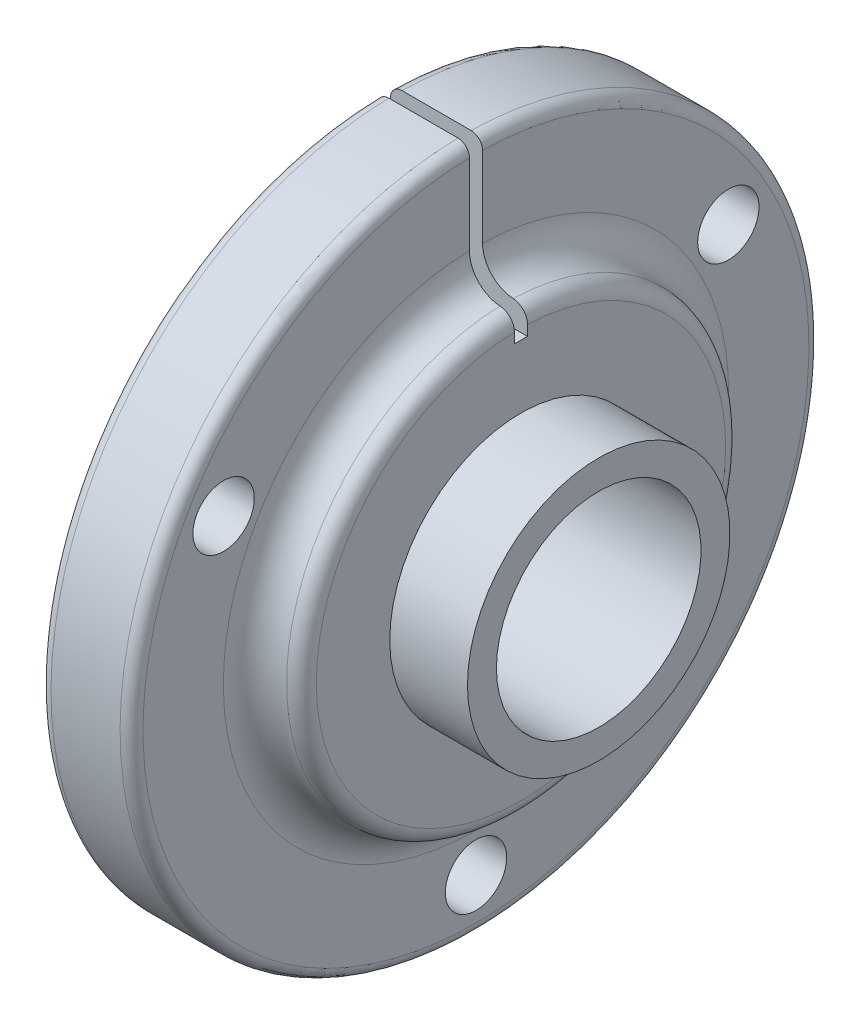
from build123d import *

# Parameters (mm, degrees)
FILLET1_R                    = 2.3876
FILLET2_R                    = 1.778
CUT_EXTRUDE_THIN1_DEPTH      = 83.63160705
CUT_EXTRUDE_THIN1_DEPTH_BACK = 83.63160705
SKETCH2_W                    = 2.032
SKETCH2_H                    = 31.75
SKETCH3_R                    = 4.7625
CUT_EXTRUDE1_DEPTH           = 83.631607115


with BuildPart() as part:
    # Sketch1 → Revolve1 (revolve)
    with BuildSketch(Plane.XY, mode=Mode.PRIVATE) as revolve1_sk:
        with BuildLine():
            Line((-4.7752, 15.875), (33.3248, 15.875))
            Line((33.3248, 15.875), (33.3248, 20.3708))
            Line((33.3248, 20.3708), (21.2598, 20.3708))
            Line((21.2598, 20.3708), (21.2598, 34.1376))
            Line((21.2598, 34.1376), (19.3548, 34.1376))
            ThreePointArc((19.3548, 34.1376), (15.762697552, 35.625497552), (14.2748, 39.2176))
            Line((14.2748, 39.2176), (14.2748, 53.467))
            Line((14.2748, 53.467), (0, 53.467))
            Line((0, 53.467), (0, 20.3708))
            Line((0, 20.3708), (-4.7752, 20.3708))
            Line((-4.7752, 20.3708), (-4.7752, 15.875))
        make_face()
    revolve(revolve1_sk.sketch.rotate(Axis((0, 0, 0), (1, 0, 0)), 90), axis=Axis((0, 0, 0), (1, 0, 0)))

    # Fillet1
    fillet1_edges = [part.edges().sort_by_distance(p)[0] for p in [
        (21.2598, 0, -34.1376),
    ]]
    fillet(fillet1_edges, radius=FILLET1_R)

    # Fillet2
    fillet2_edges = [part.edges().sort_by_distance(p)[0] for p in [
        (14.2748, 0, -53.467),
        (0, 0, -53.467),
    ]]
    fillet(fillet2_edges, radius=FILLET2_R)

    # Sketch2 → Cut-Extrude-Thin1 (cut, two sides: drawn at the far end of the back side and taken through both)
    with BuildSketch(Plane(origin=(0, 0, 0), x_dir=(0, 0, -1), z_dir=(1, 0, 0)).offset(-CUT_EXTRUDE_THIN1_DEPTH_BACK)):
        with Locations((0, 46.0375)):
            Rectangle(SKETCH2_W, SKETCH2_H)
    extrude(amount=CUT_EXTRUDE_THIN1_DEPTH + CUT_EXTRUDE_THIN1_DEPTH_BACK, mode=Mode.SUBTRACT)

    # Sketch3 → Cut-Extrude1 (cut, through all)
    with BuildSketch(Plane(origin=(0, 0, 0), x_dir=(0, 0, -1), z_dir=(1, 0, 0))):
        with Locations(Location((-39.176737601, 22.6187, 0), (0, 0, 180))):
            Circle(SKETCH3_R)
        with Locations(Location((39.176737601, 22.6187, 0), (0, 0, 180))):
            Circle(SKETCH3_R)
        with Locations(Location((0, -45.2374, 0), (0, 0, 180))):
            Circle(SKETCH3_R)
    extrude(amount=CUT_EXTRUDE1_DEPTH, mode=Mode.SUBTRACT)


solid = part.part
